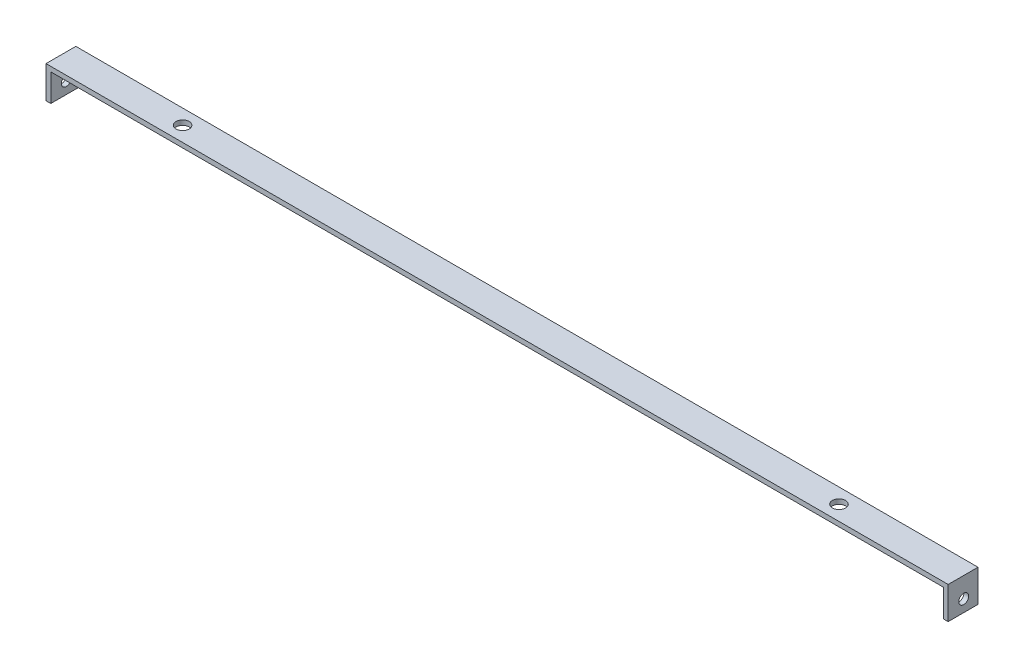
from build123d import *

# Parameters (mm, degrees)
EXTRUSION1_DEPTH        = 25
ESQUISSE2_R             = 5.5
ENL_V_MAT_EXTRU_1_DEPTH = 25
ESQUISSE3_R             = 4.137971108
ENL_V_MAT_EXTRU_2_DEPTH = 757.894972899


with BuildPart() as part:
    # Esquisse1 → Extrusion1 (new body)
    with BuildSketch(Plane.XY):
        Polygon((-73.914070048, -27), (-73.914070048, 0), (682.085929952, 0), (682.085929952, -27), (678.085929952, -27), (678.085929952, -4), (-69.914070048, -4), (-69.914070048, -27), align=None)
    extrude(amount=EXTRUSION1_DEPTH)

    # Esquisse2 → Enl_v. mat.-Extru.1 (cut)
    with BuildSketch(Plane(origin=(0, 0, 0), x_dir=(-1, 0, 0), z_dir=(0, 1, 0))):
        with Locations(Location((-578.085929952, 12.5, 0), (0, 0, 90))):
            Circle(ESQUISSE2_R)
        with Locations(Location((-28.085929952, 12.5, 0), (0, 0, 90))):
            Circle(ESQUISSE2_R)
    extrude(amount=-ENL_V_MAT_EXTRU_1_DEPTH, mode=Mode.SUBTRACT)

    # Esquisse3 → Enl_v. mat.-Extru.2 (cut, through all)
    with BuildSketch(Plane(origin=(682.085929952, 0, 0), x_dir=(0, 0, -1), z_dir=(1, 0, 0))):
        with Locations((-12, -17)):
            Circle(ESQUISSE3_R)
    extrude(amount=-ENL_V_MAT_EXTRU_2_DEPTH, mode=Mode.SUBTRACT)


solid = part.part
